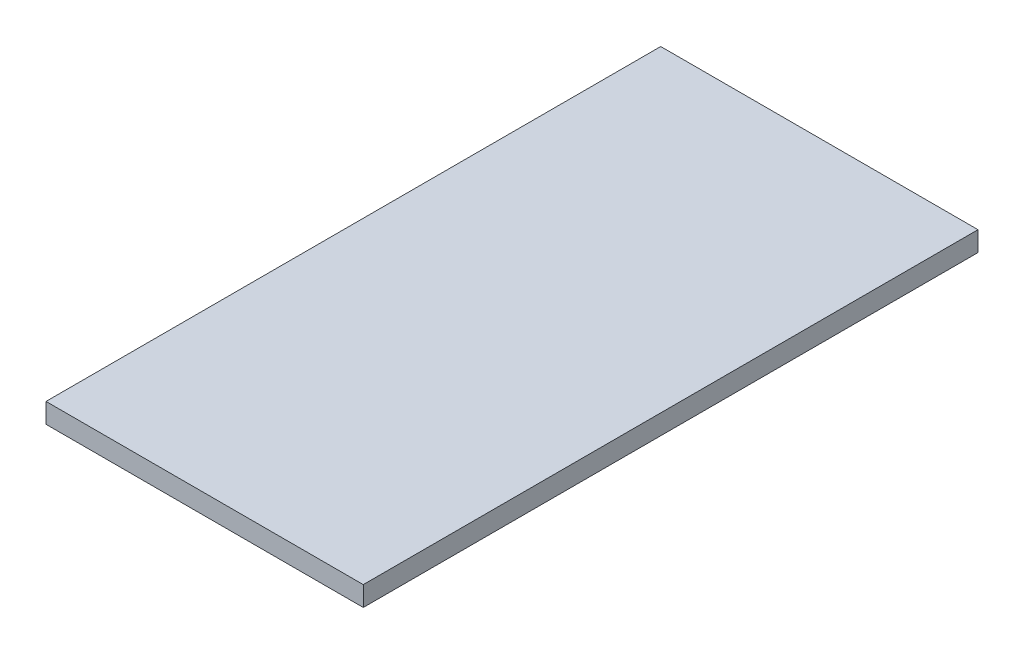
ISO-10303-21;
HEADER;
FILE_DESCRIPTION(('STEP AP214'),'2;1');
FILE_NAME('part.step','',(''),(''),'','','');
FILE_SCHEMA(('AUTOMOTIVE_DESIGN { 1 0 10303 214 1 1 1 1 }'));
ENDSEC;
DATA;
#1=APPLICATION_CONTEXT('core data for automotive mechanical design processes');
#2=APPLICATION_PROTOCOL_DEFINITION('international standard','automotive_design',2000,#1);
#3=PRODUCT_CONTEXT('',#1,'mechanical');
#4=PRODUCT('Part','Part','',(#3));
#5=PRODUCT_RELATED_PRODUCT_CATEGORY('part','',(#4));
#6=PRODUCT_DEFINITION_FORMATION('','',#4);
#7=PRODUCT_DEFINITION_CONTEXT('part definition',#1,'design');
#8=PRODUCT_DEFINITION('design','',#6,#7);
#9=PRODUCT_DEFINITION_SHAPE('','',#8);
#10=(LENGTH_UNIT() NAMED_UNIT(*) SI_UNIT(.MILLI.,.METRE.));
#11=(NAMED_UNIT(*) PLANE_ANGLE_UNIT() SI_UNIT($,.RADIAN.));
#12=(NAMED_UNIT(*) SI_UNIT($,.STERADIAN.) SOLID_ANGLE_UNIT());
#13=UNCERTAINTY_MEASURE_WITH_UNIT(LENGTH_MEASURE(1.E-05),#10,'distance_accuracy_value','');
#14=(GEOMETRIC_REPRESENTATION_CONTEXT(3) GLOBAL_UNCERTAINTY_ASSIGNED_CONTEXT((#13)) GLOBAL_UNIT_ASSIGNED_CONTEXT((#10,
#11,#12)) REPRESENTATION_CONTEXT('',''));
#15=CARTESIAN_POINT('',(0.,0.,0.));
#16=DIRECTION('',(0.,0.,1.));
#17=DIRECTION('',(1.,0.,0.));
#18=AXIS2_PLACEMENT_3D('',#15,#16,#17);
#19=CARTESIAN_POINT('',(-160.,20.,310.));
#20=DIRECTION('',(1.,0.,0.));
#21=DIRECTION('',(0.,0.,-1.));
#22=AXIS2_PLACEMENT_3D('',#19,#20,#21);
#23=PLANE('',#22);
#24=DIRECTION('',(0.,0.,1.));
#25=VECTOR('',#24,1.);
#26=CARTESIAN_POINT('',(-160.,0.,310.));
#27=LINE('',#26,#25);
#28=CARTESIAN_POINT('',(-160.,0.,-310.));
#29=VERTEX_POINT('',#28);
#30=CARTESIAN_POINT('',(-160.,0.,310.));
#31=VERTEX_POINT('',#30);
#32=EDGE_CURVE('E96',#29,#31,#27,.T.);
#33=ORIENTED_EDGE('',*,*,#32,.T.);
#34=DIRECTION('',(0.,-1.,0.));
#35=VECTOR('',#34,1.);
#36=CARTESIAN_POINT('',(-160.,20.,310.));
#37=LINE('',#36,#35);
#38=CARTESIAN_POINT('',(-160.,20.,310.));
#39=VERTEX_POINT('',#38);
#40=EDGE_CURVE('E11',#39,#31,#37,.T.);
#41=ORIENTED_EDGE('',*,*,#40,.F.);
#42=DIRECTION('',(0.,0.,1.));
#43=VECTOR('',#42,1.);
#44=CARTESIAN_POINT('',(-160.,20.,310.));
#45=LINE('',#44,#43);
#46=CARTESIAN_POINT('',(-160.,20.,-310.));
#47=VERTEX_POINT('',#46);
#48=EDGE_CURVE('E84',#47,#39,#45,.T.);
#49=ORIENTED_EDGE('',*,*,#48,.F.);
#50=DIRECTION('',(0.,-1.,0.));
#51=VECTOR('',#50,1.);
#52=CARTESIAN_POINT('',(-160.,20.,-310.));
#53=LINE('',#52,#51);
#54=EDGE_CURVE('E92',#47,#29,#53,.T.);
#55=ORIENTED_EDGE('',*,*,#54,.T.);
#56=EDGE_LOOP('',(#33,#41,#49,#55));
#57=FACE_BOUND('',#56,.T.);
#58=ADVANCED_FACE('F33',(#57),#23,.F.);
#59=CARTESIAN_POINT('',(160.,20.,310.));
#60=DIRECTION('',(0.,0.,-1.));
#61=DIRECTION('',(-1.,0.,0.));
#62=AXIS2_PLACEMENT_3D('',#59,#60,#61);
#63=PLANE('',#62);
#64=DIRECTION('',(1.,0.,0.));
#65=VECTOR('',#64,1.);
#66=CARTESIAN_POINT('',(160.,0.,310.));
#67=LINE('',#66,#65);
#68=CARTESIAN_POINT('',(160.,0.,310.));
#69=VERTEX_POINT('',#68);
#70=EDGE_CURVE('E88',#31,#69,#67,.T.);
#71=ORIENTED_EDGE('',*,*,#70,.T.);
#72=DIRECTION('',(0.,-1.,0.));
#73=VECTOR('',#72,1.);
#74=CARTESIAN_POINT('',(160.,20.,310.));
#75=LINE('',#74,#73);
#76=CARTESIAN_POINT('',(160.,20.,310.));
#77=VERTEX_POINT('',#76);
#78=EDGE_CURVE('E41',#77,#69,#75,.T.);
#79=ORIENTED_EDGE('',*,*,#78,.F.);
#80=DIRECTION('',(1.,0.,0.));
#81=VECTOR('',#80,1.);
#82=CARTESIAN_POINT('',(160.,20.,310.));
#83=LINE('',#82,#81);
#84=EDGE_CURVE('E79',#39,#77,#83,.T.);
#85=ORIENTED_EDGE('',*,*,#84,.F.);
#86=ORIENTED_EDGE('',*,*,#40,.T.);
#87=EDGE_LOOP('',(#71,#79,#85,#86));
#88=FACE_BOUND('',#87,.T.);
#89=ADVANCED_FACE('F87',(#88),#63,.F.);
#90=CARTESIAN_POINT('',(160.,20.,310.));
#91=DIRECTION('',(-1.,0.,0.));
#92=DIRECTION('',(0.,0.,1.));
#93=AXIS2_PLACEMENT_3D('',#90,#91,#92);
#94=PLANE('',#93);
#95=DIRECTION('',(0.,0.,-1.));
#96=VECTOR('',#95,1.);
#97=CARTESIAN_POINT('',(160.,0.,310.));
#98=LINE('',#97,#96);
#99=CARTESIAN_POINT('',(160.,0.,-310.));
#100=VERTEX_POINT('',#99);
#101=EDGE_CURVE('E66',#69,#100,#98,.T.);
#102=ORIENTED_EDGE('',*,*,#101,.T.);
#103=DIRECTION('',(0.,-1.,0.));
#104=VECTOR('',#103,1.);
#105=CARTESIAN_POINT('',(160.,20.,-310.));
#106=LINE('',#105,#104);
#107=CARTESIAN_POINT('',(160.,20.,-310.));
#108=VERTEX_POINT('',#107);
#109=EDGE_CURVE('E89',#108,#100,#106,.T.);
#110=ORIENTED_EDGE('',*,*,#109,.F.);
#111=DIRECTION('',(0.,0.,-1.));
#112=VECTOR('',#111,1.);
#113=CARTESIAN_POINT('',(160.,20.,310.));
#114=LINE('',#113,#112);
#115=EDGE_CURVE('E82',#77,#108,#114,.T.);
#116=ORIENTED_EDGE('',*,*,#115,.F.);
#117=ORIENTED_EDGE('',*,*,#78,.T.);
#118=EDGE_LOOP('',(#102,#110,#116,#117));
#119=FACE_BOUND('',#118,.T.);
#120=ADVANCED_FACE('F90',(#119),#94,.F.);
#121=CARTESIAN_POINT('',(160.,20.,-310.));
#122=DIRECTION('',(0.,0.,1.));
#123=DIRECTION('',(1.,0.,0.));
#124=AXIS2_PLACEMENT_3D('',#121,#122,#123);
#125=PLANE('',#124);
#126=DIRECTION('',(-1.,0.,0.));
#127=VECTOR('',#126,1.);
#128=CARTESIAN_POINT('',(160.,0.,-310.));
#129=LINE('',#128,#127);
#130=EDGE_CURVE('E72',#100,#29,#129,.T.);
#131=ORIENTED_EDGE('',*,*,#130,.T.);
#132=ORIENTED_EDGE('',*,*,#54,.F.);
#133=DIRECTION('',(-1.,0.,0.));
#134=VECTOR('',#133,1.);
#135=CARTESIAN_POINT('',(160.,20.,-310.));
#136=LINE('',#135,#134);
#137=EDGE_CURVE('E49',#108,#47,#136,.T.);
#138=ORIENTED_EDGE('',*,*,#137,.F.);
#139=ORIENTED_EDGE('',*,*,#109,.T.);
#140=EDGE_LOOP('',(#131,#132,#138,#139));
#141=FACE_BOUND('',#140,.T.);
#142=ADVANCED_FACE('F103',(#141),#125,.F.);
#143=CARTESIAN_POINT('',(0.,20.,0.));
#144=DIRECTION('',(0.,1.,0.));
#145=DIRECTION('',(0.,0.,1.));
#146=AXIS2_PLACEMENT_3D('',#143,#144,#145);
#147=PLANE('',#146);
#148=ORIENTED_EDGE('',*,*,#48,.T.);
#149=ORIENTED_EDGE('',*,*,#84,.T.);
#150=ORIENTED_EDGE('',*,*,#115,.T.);
#151=ORIENTED_EDGE('',*,*,#137,.T.);
#152=EDGE_LOOP('',(#148,#149,#150,#151));
#153=FACE_BOUND('',#152,.T.);
#154=ADVANCED_FACE('F80',(#153),#147,.T.);
#155=CARTESIAN_POINT('',(0.,0.,0.));
#156=DIRECTION('',(0.,1.,0.));
#157=DIRECTION('',(0.,0.,1.));
#158=AXIS2_PLACEMENT_3D('',#155,#156,#157);
#159=PLANE('',#158);
#160=ORIENTED_EDGE('',*,*,#32,.F.);
#161=ORIENTED_EDGE('',*,*,#130,.F.);
#162=ORIENTED_EDGE('',*,*,#101,.F.);
#163=ORIENTED_EDGE('',*,*,#70,.F.);
#164=EDGE_LOOP('',(#160,#161,#162,#163));
#165=FACE_BOUND('',#164,.T.);
#166=ADVANCED_FACE('F106',(#165),#159,.F.);
#167=CLOSED_SHELL('',(#58,#89,#120,#142,#154,#166));
#168=MANIFOLD_SOLID_BREP('B2',#167);
#169=ADVANCED_BREP_SHAPE_REPRESENTATION('',(#18,#168),#14);
#170=SHAPE_DEFINITION_REPRESENTATION(#9,#169);
ENDSEC;
END-ISO-10303-21;
